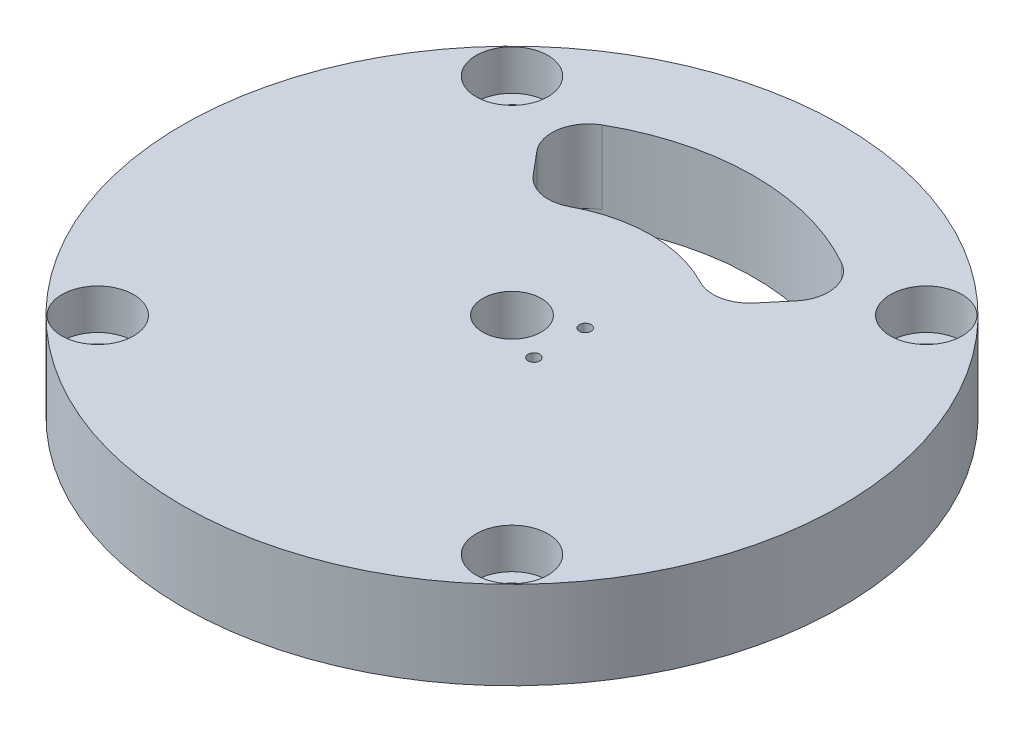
ISO-10303-21;
HEADER;
FILE_DESCRIPTION(('STEP AP214'),'2;1');
FILE_NAME('part.step','',(''),(''),'','','');
FILE_SCHEMA(('AUTOMOTIVE_DESIGN { 1 0 10303 214 1 1 1 1 }'));
ENDSEC;
DATA;
#1=APPLICATION_CONTEXT('core data for automotive mechanical design processes');
#2=APPLICATION_PROTOCOL_DEFINITION('international standard','automotive_design',2000,#1);
#3=PRODUCT_CONTEXT('',#1,'mechanical');
#4=PRODUCT('Part','Part','',(#3));
#5=PRODUCT_RELATED_PRODUCT_CATEGORY('part','',(#4));
#6=PRODUCT_DEFINITION_FORMATION('','',#4);
#7=PRODUCT_DEFINITION_CONTEXT('part definition',#1,'design');
#8=PRODUCT_DEFINITION('design','',#6,#7);
#9=PRODUCT_DEFINITION_SHAPE('','',#8);
#10=(LENGTH_UNIT() NAMED_UNIT(*) SI_UNIT(.MILLI.,.METRE.));
#11=(NAMED_UNIT(*) PLANE_ANGLE_UNIT() SI_UNIT($,.RADIAN.));
#12=(NAMED_UNIT(*) SI_UNIT($,.STERADIAN.) SOLID_ANGLE_UNIT());
#13=UNCERTAINTY_MEASURE_WITH_UNIT(LENGTH_MEASURE(1.E-05),#10,'distance_accuracy_value','');
#14=(GEOMETRIC_REPRESENTATION_CONTEXT(3) GLOBAL_UNCERTAINTY_ASSIGNED_CONTEXT((#13)) GLOBAL_UNIT_ASSIGNED_CONTEXT((#10,
#11,#12)) REPRESENTATION_CONTEXT('',''));
#15=CARTESIAN_POINT('',(0.,0.,0.));
#16=DIRECTION('',(0.,0.,1.));
#17=DIRECTION('',(1.,0.,0.));
#18=AXIS2_PLACEMENT_3D('',#15,#16,#17);
#19=CARTESIAN_POINT('',(0.,12.,0.));
#20=DIRECTION('',(0.,-1.,0.));
#21=DIRECTION('',(0.,0.,-1.));
#22=AXIS2_PLACEMENT_3D('',#19,#20,#21);
#23=CYLINDRICAL_SURFACE('',#22,19.);
#24=CARTESIAN_POINT('',(0.,2.,0.));
#25=DIRECTION('',(0.,-1.,0.));
#26=DIRECTION('',(0.,0.,-1.));
#27=AXIS2_PLACEMENT_3D('',#24,#25,#26);
#28=CIRCLE('',#27,19.);
#29=CARTESIAN_POINT('',(-8.91272703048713,2.,-16.779847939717));
#30=VERTEX_POINT('',#29);
#31=CARTESIAN_POINT('',(8.91272703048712,2.,-16.779847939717));
#32=VERTEX_POINT('',#31);
#33=EDGE_CURVE('E132',#30,#32,#28,.T.);
#34=ORIENTED_EDGE('',*,*,#33,.F.);
#35=DIRECTION('',(0.,-1.,0.));
#36=VECTOR('',#35,1.);
#37=CARTESIAN_POINT('',(-8.91272703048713,12.,-16.779847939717));
#38=LINE('',#37,#36);
#39=CARTESIAN_POINT('',(-8.91272703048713,12.,-16.779847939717));
#40=VERTEX_POINT('',#39);
#41=EDGE_CURVE('E57',#40,#30,#38,.T.);
#42=ORIENTED_EDGE('',*,*,#41,.F.);
#43=CARTESIAN_POINT('',(0.,12.,0.));
#44=DIRECTION('',(0.,1.,0.));
#45=DIRECTION('',(0.,0.,1.));
#46=AXIS2_PLACEMENT_3D('',#43,#44,#45);
#47=CIRCLE('',#46,19.);
#48=CARTESIAN_POINT('',(8.91272703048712,12.,-16.779847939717));
#49=VERTEX_POINT('',#48);
#50=EDGE_CURVE('E240',#49,#40,#47,.T.);
#51=ORIENTED_EDGE('',*,*,#50,.F.);
#52=DIRECTION('',(0.,-1.,0.));
#53=VECTOR('',#52,1.);
#54=CARTESIAN_POINT('',(8.91272703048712,12.,-16.779847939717));
#55=LINE('',#54,#53);
#56=EDGE_CURVE('E63',#49,#32,#55,.T.);
#57=ORIENTED_EDGE('',*,*,#56,.T.);
#58=EDGE_LOOP('',(#34,#42,#51,#57));
#59=FACE_BOUND('',#58,.T.);
#60=ADVANCED_FACE('F48',(#59),#23,.T.);
#61=CARTESIAN_POINT('',(-11.2581815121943,12.,-21.1955973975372));
#62=DIRECTION('',(0.,-1.,0.));
#63=DIRECTION('',(0.,0.,-1.));
#64=AXIS2_PLACEMENT_3D('',#61,#62,#63);
#65=CYLINDRICAL_SURFACE('',#64,5.);
#66=CARTESIAN_POINT('',(-11.2581815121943,2.,-21.1955973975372));
#67=DIRECTION('',(0.,-1.,0.));
#68=DIRECTION('',(0.,0.,-1.));
#69=AXIS2_PLACEMENT_3D('',#66,#67,#68);
#70=CIRCLE('',#69,5.);
#71=CARTESIAN_POINT('',(-15.0884037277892,2.,-17.9816593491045));
#72=VERTEX_POINT('',#71);
#73=EDGE_CURVE('E307',#72,#30,#70,.F.);
#74=ORIENTED_EDGE('',*,*,#73,.F.);
#75=DIRECTION('',(0.,-1.,0.));
#76=VECTOR('',#75,1.);
#77=CARTESIAN_POINT('',(-15.0884037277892,12.,-17.9816593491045));
#78=LINE('',#77,#76);
#79=CARTESIAN_POINT('',(-15.0884037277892,12.,-17.9816593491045));
#80=VERTEX_POINT('',#79);
#81=EDGE_CURVE('E161',#80,#72,#78,.T.);
#82=ORIENTED_EDGE('',*,*,#81,.F.);
#83=CARTESIAN_POINT('',(-11.2581815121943,12.,-21.1955973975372));
#84=DIRECTION('',(0.,1.,0.));
#85=DIRECTION('',(0.,0.,1.));
#86=AXIS2_PLACEMENT_3D('',#83,#84,#85);
#87=CIRCLE('',#86,5.);
#88=EDGE_CURVE('E237',#40,#80,#87,.F.);
#89=ORIENTED_EDGE('',*,*,#88,.F.);
#90=ORIENTED_EDGE('',*,*,#41,.T.);
#91=EDGE_LOOP('',(#74,#82,#89,#90));
#92=FACE_BOUND('',#91,.T.);
#93=ADVANCED_FACE('F326',(#92),#65,.F.);
#94=CARTESIAN_POINT('',(0.,12.,0.));
#95=DIRECTION('',(-0.766044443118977,0.,0.642787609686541));
#96=DIRECTION('',(0.642787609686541,0.,0.766044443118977));
#97=AXIS2_PLACEMENT_3D('',#94,#95,#96);
#98=PLANE('',#97);
#99=DIRECTION('',(0.642787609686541,0.,0.766044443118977));
#100=VECTOR('',#99,1.);
#101=CARTESIAN_POINT('',(0.,2.,0.));
#102=LINE('',#101,#100);
#103=CARTESIAN_POINT('',(-17.7087694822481,2.,-21.1044896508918));
#104=VERTEX_POINT('',#103);
#105=EDGE_CURVE('E304',#104,#72,#102,.T.);
#106=ORIENTED_EDGE('',*,*,#105,.F.);
#107=DIRECTION('',(0.,-1.,0.));
#108=VECTOR('',#107,1.);
#109=CARTESIAN_POINT('',(-17.7087694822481,12.,-21.1044896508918));
#110=LINE('',#109,#108);
#111=CARTESIAN_POINT('',(-17.7087694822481,12.,-21.1044896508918));
#112=VERTEX_POINT('',#111);
#113=EDGE_CURVE('E153',#112,#104,#110,.T.);
#114=ORIENTED_EDGE('',*,*,#113,.F.);
#115=DIRECTION('',(-0.642787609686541,0.,-0.766044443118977));
#116=VECTOR('',#115,1.);
#117=CARTESIAN_POINT('',(0.,12.,0.));
#118=LINE('',#117,#116);
#119=EDGE_CURVE('E234',#80,#112,#118,.T.);
#120=ORIENTED_EDGE('',*,*,#119,.F.);
#121=ORIENTED_EDGE('',*,*,#81,.T.);
#122=EDGE_LOOP('',(#106,#114,#120,#121));
#123=FACE_BOUND('',#122,.T.);
#124=ADVANCED_FACE('F323',(#123),#98,.F.);
#125=CARTESIAN_POINT('',(-13.8785472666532,12.,-24.3184276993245));
#126=DIRECTION('',(0.,-1.,0.));
#127=DIRECTION('',(0.,0.,-1.));
#128=AXIS2_PLACEMENT_3D('',#125,#126,#127);
#129=CYLINDRICAL_SURFACE('',#128,5.);
#130=CARTESIAN_POINT('',(-13.8785472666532,2.,-24.3184276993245));
#131=DIRECTION('',(0.,-1.,0.));
#132=DIRECTION('',(0.,0.,-1.));
#133=AXIS2_PLACEMENT_3D('',#130,#131,#132);
#134=CIRCLE('',#133,5.);
#135=CARTESIAN_POINT('',(-16.3568592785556,2.,-28.6610040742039));
#136=VERTEX_POINT('',#135);
#137=EDGE_CURVE('E301',#136,#104,#134,.F.);
#138=ORIENTED_EDGE('',*,*,#137,.F.);
#139=DIRECTION('',(0.,-1.,0.));
#140=VECTOR('',#139,1.);
#141=CARTESIAN_POINT('',(-16.3568592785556,12.,-28.6610040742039));
#142=LINE('',#141,#140);
#143=CARTESIAN_POINT('',(-16.3568592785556,12.,-28.6610040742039));
#144=VERTEX_POINT('',#143);
#145=EDGE_CURVE('E141',#144,#136,#142,.T.);
#146=ORIENTED_EDGE('',*,*,#145,.F.);
#147=CARTESIAN_POINT('',(-13.8785472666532,12.,-24.3184276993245));
#148=DIRECTION('',(0.,1.,0.));
#149=DIRECTION('',(0.,0.,1.));
#150=AXIS2_PLACEMENT_3D('',#147,#148,#149);
#151=CIRCLE('',#150,5.);
#152=EDGE_CURVE('E231',#112,#144,#151,.F.);
#153=ORIENTED_EDGE('',*,*,#152,.F.);
#154=ORIENTED_EDGE('',*,*,#113,.T.);
#155=EDGE_LOOP('',(#138,#146,#153,#154));
#156=FACE_BOUND('',#155,.T.);
#157=ADVANCED_FACE('F319',(#156),#129,.F.);
#158=CARTESIAN_POINT('',(13.8785472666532,12.,-24.3184276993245));
#159=DIRECTION('',(0.,-1.,0.));
#160=DIRECTION('',(0.,0.,-1.));
#161=AXIS2_PLACEMENT_3D('',#158,#159,#160);
#162=CYLINDRICAL_SURFACE('',#161,5.);
#163=DIRECTION('',(0.,-1.,0.));
#164=VECTOR('',#163,1.);
#165=CARTESIAN_POINT('',(16.3568592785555,12.,-28.6610040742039));
#166=LINE('',#165,#164);
#167=CARTESIAN_POINT('',(16.3568592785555,12.,-28.6610040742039));
#168=VERTEX_POINT('',#167);
#169=CARTESIAN_POINT('',(16.3568592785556,2.,-28.6610040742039));
#170=VERTEX_POINT('',#169);
#171=EDGE_CURVE('E138',#168,#170,#166,.T.);
#172=ORIENTED_EDGE('',*,*,#171,.T.);
#173=CARTESIAN_POINT('',(13.8785472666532,2.,-24.3184276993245));
#174=DIRECTION('',(0.,-1.,0.));
#175=DIRECTION('',(0.,0.,-1.));
#176=AXIS2_PLACEMENT_3D('',#173,#174,#175);
#177=CIRCLE('',#176,5.);
#178=CARTESIAN_POINT('',(17.7087694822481,2.,-21.1044896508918));
#179=VERTEX_POINT('',#178);
#180=EDGE_CURVE('E122',#170,#179,#177,.T.);
#181=ORIENTED_EDGE('',*,*,#180,.T.);
#182=DIRECTION('',(0.,-1.,0.));
#183=VECTOR('',#182,1.);
#184=CARTESIAN_POINT('',(17.7087694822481,12.,-21.1044896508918));
#185=LINE('',#184,#183);
#186=CARTESIAN_POINT('',(17.7087694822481,12.,-21.1044896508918));
#187=VERTEX_POINT('',#186);
#188=EDGE_CURVE('E149',#187,#179,#185,.T.);
#189=ORIENTED_EDGE('',*,*,#188,.F.);
#190=CARTESIAN_POINT('',(13.8785472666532,12.,-24.3184276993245));
#191=DIRECTION('',(0.,1.,0.));
#192=DIRECTION('',(0.,0.,1.));
#193=AXIS2_PLACEMENT_3D('',#190,#191,#192);
#194=CIRCLE('',#193,5.);
#195=EDGE_CURVE('E147',#187,#168,#194,.T.);
#196=ORIENTED_EDGE('',*,*,#195,.T.);
#197=EDGE_LOOP('',(#172,#181,#189,#196));
#198=FACE_BOUND('',#197,.T.);
#199=ADVANCED_FACE('F145',(#198),#162,.F.);
#200=CARTESIAN_POINT('',(0.,12.,0.));
#201=DIRECTION('',(-0.766044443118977,0.,-0.64278760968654));
#202=DIRECTION('',(-0.64278760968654,0.,0.766044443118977));
#203=AXIS2_PLACEMENT_3D('',#200,#201,#202);
#204=PLANE('',#203);
#205=ORIENTED_EDGE('',*,*,#188,.T.);
#206=DIRECTION('',(-0.64278760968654,0.,0.766044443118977));
#207=VECTOR('',#206,1.);
#208=CARTESIAN_POINT('',(0.,2.,0.));
#209=LINE('',#208,#207);
#210=CARTESIAN_POINT('',(15.0884037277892,2.,-17.9816593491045));
#211=VERTEX_POINT('',#210);
#212=EDGE_CURVE('E127',#179,#211,#209,.T.);
#213=ORIENTED_EDGE('',*,*,#212,.T.);
#214=DIRECTION('',(0.,-1.,0.));
#215=VECTOR('',#214,1.);
#216=CARTESIAN_POINT('',(15.0884037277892,12.,-17.9816593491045));
#217=LINE('',#216,#215);
#218=CARTESIAN_POINT('',(15.0884037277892,12.,-17.9816593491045));
#219=VERTEX_POINT('',#218);
#220=EDGE_CURVE('E71',#219,#211,#217,.T.);
#221=ORIENTED_EDGE('',*,*,#220,.F.);
#222=DIRECTION('',(0.64278760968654,0.,-0.766044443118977));
#223=VECTOR('',#222,1.);
#224=CARTESIAN_POINT('',(0.,12.,0.));
#225=LINE('',#224,#223);
#226=EDGE_CURVE('E223',#219,#187,#225,.T.);
#227=ORIENTED_EDGE('',*,*,#226,.T.);
#228=EDGE_LOOP('',(#205,#213,#221,#227));
#229=FACE_BOUND('',#228,.T.);
#230=ADVANCED_FACE('F313',(#229),#204,.T.);
#231=CARTESIAN_POINT('',(0.,12.,0.));
#232=DIRECTION('',(0.,-1.,0.));
#233=DIRECTION('',(0.,0.,-1.));
#234=AXIS2_PLACEMENT_3D('',#231,#232,#233);
#235=CYLINDRICAL_SURFACE('',#234,4.);
#236=CARTESIAN_POINT('',(0.,12.,0.));
#237=DIRECTION('',(0.,1.,0.));
#238=DIRECTION('',(0.,0.,1.));
#239=AXIS2_PLACEMENT_3D('',#236,#237,#238);
#240=CIRCLE('',#239,4.);
#241=CARTESIAN_POINT('',(0.,12.,4.));
#242=VERTEX_POINT('',#241);
#243=EDGE_CURVE('E215',#242,#242,#240,.T.);
#244=ORIENTED_EDGE('',*,*,#243,.T.);
#245=EDGE_LOOP('',(#244));
#246=FACE_BOUND('',#245,.T.);
#247=CARTESIAN_POINT('',(0.,2.,0.));
#248=DIRECTION('',(0.,-1.,0.));
#249=DIRECTION('',(0.,0.,-1.));
#250=AXIS2_PLACEMENT_3D('',#247,#248,#249);
#251=CIRCLE('',#250,4.);
#252=CARTESIAN_POINT('',(0.,2.,-4.));
#253=VERTEX_POINT('',#252);
#254=EDGE_CURVE('E297',#253,#253,#251,.T.);
#255=ORIENTED_EDGE('',*,*,#254,.T.);
#256=EDGE_LOOP('',(#255));
#257=FACE_BOUND('',#256,.T.);
#258=ADVANCED_FACE('F342',(#246,#257),#235,.F.);
#259=CARTESIAN_POINT('',(11.2581815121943,12.,-21.1955973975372));
#260=DIRECTION('',(0.,-1.,0.));
#261=DIRECTION('',(0.,0.,-1.));
#262=AXIS2_PLACEMENT_3D('',#259,#260,#261);
#263=CYLINDRICAL_SURFACE('',#262,5.);
#264=ORIENTED_EDGE('',*,*,#220,.T.);
#265=CARTESIAN_POINT('',(11.2581815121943,2.,-21.1955973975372));
#266=DIRECTION('',(0.,-1.,0.));
#267=DIRECTION('',(0.,0.,-1.));
#268=AXIS2_PLACEMENT_3D('',#265,#266,#267);
#269=CIRCLE('',#268,5.);
#270=EDGE_CURVE('E11',#211,#32,#269,.T.);
#271=ORIENTED_EDGE('',*,*,#270,.T.);
#272=ORIENTED_EDGE('',*,*,#56,.F.);
#273=CARTESIAN_POINT('',(11.2581815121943,12.,-21.1955973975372));
#274=DIRECTION('',(0.,1.,0.));
#275=DIRECTION('',(0.,0.,1.));
#276=AXIS2_PLACEMENT_3D('',#273,#274,#275);
#277=CIRCLE('',#276,5.);
#278=EDGE_CURVE('E197',#49,#219,#277,.T.);
#279=ORIENTED_EDGE('',*,*,#278,.T.);
#280=EDGE_LOOP('',(#264,#271,#272,#279));
#281=FACE_BOUND('',#280,.T.);
#282=ADVANCED_FACE('F218',(#281),#263,.F.);
#283=CARTESIAN_POINT('',(28.2842712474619,12.,-28.2842712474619));
#284=DIRECTION('',(0.,-1.,0.));
#285=DIRECTION('',(0.,0.,-1.));
#286=AXIS2_PLACEMENT_3D('',#283,#284,#285);
#287=CYLINDRICAL_SURFACE('',#286,3.);
#288=CARTESIAN_POINT('',(28.2842712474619,0.,-28.2842712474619));
#289=DIRECTION('',(0.,1.,0.));
#290=DIRECTION('',(0.,0.,1.));
#291=AXIS2_PLACEMENT_3D('',#288,#289,#290);
#292=CIRCLE('',#291,3.);
#293=CARTESIAN_POINT('',(28.2842712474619,0.,-25.2842712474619));
#294=VERTEX_POINT('',#293);
#295=EDGE_CURVE('E203',#294,#294,#292,.T.);
#296=ORIENTED_EDGE('',*,*,#295,.F.);
#297=EDGE_LOOP('',(#296));
#298=FACE_BOUND('',#297,.T.);
#299=CARTESIAN_POINT('',(28.2842712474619,6.5,-28.2842712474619));
#300=DIRECTION('',(0.,1.,0.));
#301=DIRECTION('',(0.,0.,1.));
#302=AXIS2_PLACEMENT_3D('',#299,#300,#301);
#303=CIRCLE('',#302,3.);
#304=CARTESIAN_POINT('',(28.2842712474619,6.5,-25.2842712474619));
#305=VERTEX_POINT('',#304);
#306=EDGE_CURVE('E180',#305,#305,#303,.T.);
#307=ORIENTED_EDGE('',*,*,#306,.T.);
#308=EDGE_LOOP('',(#307));
#309=FACE_BOUND('',#308,.T.);
#310=ADVANCED_FACE('F346',(#298,#309),#287,.F.);
#311=CARTESIAN_POINT('',(28.2842712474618,12.,28.2842712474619));
#312=DIRECTION('',(0.,-1.,0.));
#313=DIRECTION('',(0.,0.,-1.));
#314=AXIS2_PLACEMENT_3D('',#311,#312,#313);
#315=CYLINDRICAL_SURFACE('',#314,2.99999999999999);
#316=CARTESIAN_POINT('',(28.2842712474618,0.,28.2842712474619));
#317=DIRECTION('',(0.,1.,0.));
#318=DIRECTION('',(0.,0.,1.));
#319=AXIS2_PLACEMENT_3D('',#316,#317,#318);
#320=CIRCLE('',#319,2.99999999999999);
#321=CARTESIAN_POINT('',(28.2842712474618,0.,31.2842712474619));
#322=VERTEX_POINT('',#321);
#323=EDGE_CURVE('E194',#322,#322,#320,.T.);
#324=ORIENTED_EDGE('',*,*,#323,.F.);
#325=EDGE_LOOP('',(#324));
#326=FACE_BOUND('',#325,.T.);
#327=CARTESIAN_POINT('',(28.2842712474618,6.5,28.2842712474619));
#328=DIRECTION('',(0.,1.,0.));
#329=DIRECTION('',(0.,0.,1.));
#330=AXIS2_PLACEMENT_3D('',#327,#328,#329);
#331=CIRCLE('',#330,2.99999999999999);
#332=CARTESIAN_POINT('',(28.2842712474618,6.5,31.2842712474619));
#333=VERTEX_POINT('',#332);
#334=EDGE_CURVE('E177',#333,#333,#331,.T.);
#335=ORIENTED_EDGE('',*,*,#334,.T.);
#336=EDGE_LOOP('',(#335));
#337=FACE_BOUND('',#336,.T.);
#338=ADVANCED_FACE('F349',(#326,#337),#315,.F.);
#339=CARTESIAN_POINT('',(-28.2842712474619,12.,28.2842712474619));
#340=DIRECTION('',(0.,-1.,0.));
#341=DIRECTION('',(0.,0.,-1.));
#342=AXIS2_PLACEMENT_3D('',#339,#340,#341);
#343=CYLINDRICAL_SURFACE('',#342,3.);
#344=CARTESIAN_POINT('',(-28.2842712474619,0.,28.2842712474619));
#345=DIRECTION('',(0.,1.,0.));
#346=DIRECTION('',(0.,0.,1.));
#347=AXIS2_PLACEMENT_3D('',#344,#345,#346);
#348=CIRCLE('',#347,3.);
#349=CARTESIAN_POINT('',(-28.2842712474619,0.,31.2842712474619));
#350=VERTEX_POINT('',#349);
#351=EDGE_CURVE('E188',#350,#350,#348,.T.);
#352=ORIENTED_EDGE('',*,*,#351,.F.);
#353=EDGE_LOOP('',(#352));
#354=FACE_BOUND('',#353,.T.);
#355=CARTESIAN_POINT('',(-28.2842712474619,6.5,28.2842712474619));
#356=DIRECTION('',(0.,1.,0.));
#357=DIRECTION('',(0.,0.,1.));
#358=AXIS2_PLACEMENT_3D('',#355,#356,#357);
#359=CIRCLE('',#358,3.);
#360=CARTESIAN_POINT('',(-28.2842712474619,6.5,31.2842712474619));
#361=VERTEX_POINT('',#360);
#362=EDGE_CURVE('E172',#361,#361,#359,.T.);
#363=ORIENTED_EDGE('',*,*,#362,.T.);
#364=EDGE_LOOP('',(#363));
#365=FACE_BOUND('',#364,.T.);
#366=ADVANCED_FACE('F352',(#354,#365),#343,.F.);
#367=CARTESIAN_POINT('',(-28.2842712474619,12.,-28.2842712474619));
#368=DIRECTION('',(0.,-1.,0.));
#369=DIRECTION('',(0.,0.,-1.));
#370=AXIS2_PLACEMENT_3D('',#367,#368,#369);
#371=CYLINDRICAL_SURFACE('',#370,3.);
#372=CARTESIAN_POINT('',(-28.2842712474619,0.,-28.2842712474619));
#373=DIRECTION('',(0.,1.,0.));
#374=DIRECTION('',(0.,0.,1.));
#375=AXIS2_PLACEMENT_3D('',#372,#373,#374);
#376=CIRCLE('',#375,3.);
#377=CARTESIAN_POINT('',(-28.2842712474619,0.,-25.2842712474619));
#378=VERTEX_POINT('',#377);
#379=EDGE_CURVE('E183',#378,#378,#376,.T.);
#380=ORIENTED_EDGE('',*,*,#379,.F.);
#381=EDGE_LOOP('',(#380));
#382=FACE_BOUND('',#381,.T.);
#383=CARTESIAN_POINT('',(-28.2842712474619,6.5,-28.2842712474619));
#384=DIRECTION('',(0.,1.,0.));
#385=DIRECTION('',(0.,0.,1.));
#386=AXIS2_PLACEMENT_3D('',#383,#384,#385);
#387=CIRCLE('',#386,3.);
#388=CARTESIAN_POINT('',(-28.2842712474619,6.5,-25.2842712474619));
#389=VERTEX_POINT('',#388);
#390=EDGE_CURVE('E168',#389,#389,#387,.T.);
#391=ORIENTED_EDGE('',*,*,#390,.T.);
#392=EDGE_LOOP('',(#391));
#393=FACE_BOUND('',#392,.T.);
#394=ADVANCED_FACE('F50',(#382,#393),#371,.F.);
#395=CARTESIAN_POINT('',(0.,12.,0.));
#396=DIRECTION('',(0.,-1.,0.));
#397=DIRECTION('',(0.,0.,-1.));
#398=AXIS2_PLACEMENT_3D('',#395,#396,#397);
#399=CYLINDRICAL_SURFACE('',#398,33.);
#400=CARTESIAN_POINT('',(0.,0.,0.));
#401=DIRECTION('',(0.,1.,0.));
#402=DIRECTION('',(0.,0.,1.));
#403=AXIS2_PLACEMENT_3D('',#400,#401,#402);
#404=CIRCLE('',#403,33.);
#405=CARTESIAN_POINT('',(0.,0.,33.));
#406=VERTEX_POINT('',#405);
#407=EDGE_CURVE('E211',#406,#406,#404,.T.);
#408=ORIENTED_EDGE('',*,*,#407,.F.);
#409=EDGE_LOOP('',(#408));
#410=FACE_BOUND('',#409,.T.);
#411=CARTESIAN_POINT('',(0.,2.,0.));
#412=DIRECTION('',(0.,-1.,0.));
#413=DIRECTION('',(0.,0.,-1.));
#414=AXIS2_PLACEMENT_3D('',#411,#412,#413);
#415=CIRCLE('',#414,33.);
#416=EDGE_CURVE('E125',#170,#136,#415,.T.);
#417=ORIENTED_EDGE('',*,*,#416,.F.);
#418=ORIENTED_EDGE('',*,*,#171,.F.);
#419=CARTESIAN_POINT('',(0.,12.,0.));
#420=DIRECTION('',(0.,1.,0.));
#421=DIRECTION('',(0.,0.,1.));
#422=AXIS2_PLACEMENT_3D('',#419,#420,#421);
#423=CIRCLE('',#422,33.);
#424=EDGE_CURVE('E226',#168,#144,#423,.T.);
#425=ORIENTED_EDGE('',*,*,#424,.T.);
#426=ORIENTED_EDGE('',*,*,#145,.T.);
#427=EDGE_LOOP('',(#417,#418,#425,#426));
#428=FACE_BOUND('',#427,.T.);
#429=ADVANCED_FACE('F136',(#410,#428),#399,.F.);
#430=CARTESIAN_POINT('',(0.,12.,0.));
#431=DIRECTION('',(0.,-1.,0.));
#432=DIRECTION('',(0.,0.,-1.));
#433=AXIS2_PLACEMENT_3D('',#430,#431,#432);
#434=CYLINDRICAL_SURFACE('',#433,45.);
#435=CARTESIAN_POINT('',(0.,12.,0.));
#436=DIRECTION('',(0.,1.,0.));
#437=DIRECTION('',(0.,0.,1.));
#438=AXIS2_PLACEMENT_3D('',#435,#436,#437);
#439=CIRCLE('',#438,45.);
#440=CARTESIAN_POINT('',(0.,12.,45.));
#441=VERTEX_POINT('',#440);
#442=EDGE_CURVE('E243',#441,#441,#439,.T.);
#443=ORIENTED_EDGE('',*,*,#442,.F.);
#444=EDGE_LOOP('',(#443));
#445=FACE_BOUND('',#444,.T.);
#446=CARTESIAN_POINT('',(0.,0.,0.));
#447=DIRECTION('',(0.,1.,0.));
#448=DIRECTION('',(0.,0.,1.));
#449=AXIS2_PLACEMENT_3D('',#446,#447,#448);
#450=CIRCLE('',#449,45.);
#451=CARTESIAN_POINT('',(0.,0.,45.));
#452=VERTEX_POINT('',#451);
#453=EDGE_CURVE('E207',#452,#452,#450,.T.);
#454=ORIENTED_EDGE('',*,*,#453,.T.);
#455=EDGE_LOOP('',(#454));
#456=FACE_BOUND('',#455,.T.);
#457=ADVANCED_FACE('F338',(#445,#456),#434,.T.);
#458=CARTESIAN_POINT('',(0.,12.,0.));
#459=DIRECTION('',(0.,1.,0.));
#460=DIRECTION('',(0.,0.,1.));
#461=AXIS2_PLACEMENT_3D('',#458,#459,#460);
#462=PLANE('',#461);
#463=CARTESIAN_POINT('',(6.5,12.,-3.5));
#464=DIRECTION('',(0.,1.,0.));
#465=DIRECTION('',(0.,0.,1.));
#466=AXIS2_PLACEMENT_3D('',#463,#464,#465);
#467=CIRCLE('',#466,0.79999999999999);
#468=CARTESIAN_POINT('',(6.5,12.,-2.70000000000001));
#469=VERTEX_POINT('',#468);
#470=EDGE_CURVE('E293',#469,#469,#467,.T.);
#471=ORIENTED_EDGE('',*,*,#470,.F.);
#472=EDGE_LOOP('',(#471));
#473=FACE_BOUND('',#472,.T.);
#474=CARTESIAN_POINT('',(6.5,12.,3.5));
#475=DIRECTION('',(0.,1.,0.));
#476=DIRECTION('',(0.,0.,1.));
#477=AXIS2_PLACEMENT_3D('',#474,#475,#476);
#478=CIRCLE('',#477,0.79999999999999);
#479=CARTESIAN_POINT('',(6.5,12.,4.29999999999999));
#480=VERTEX_POINT('',#479);
#481=EDGE_CURVE('E285',#480,#480,#478,.T.);
#482=ORIENTED_EDGE('',*,*,#481,.F.);
#483=EDGE_LOOP('',(#482));
#484=FACE_BOUND('',#483,.T.);
#485=CARTESIAN_POINT('',(-28.2842712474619,12.,-28.2842712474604));
#486=DIRECTION('',(0.,1.,0.));
#487=DIRECTION('',(0.,0.,1.));
#488=AXIS2_PLACEMENT_3D('',#485,#486,#487);
#489=CIRCLE('',#488,4.9);
#490=CARTESIAN_POINT('',(-28.2842712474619,12.,-23.3842712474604));
#491=VERTEX_POINT('',#490);
#492=EDGE_CURVE('E262',#491,#491,#489,.T.);
#493=ORIENTED_EDGE('',*,*,#492,.F.);
#494=EDGE_LOOP('',(#493));
#495=FACE_BOUND('',#494,.T.);
#496=CARTESIAN_POINT('',(-28.2842712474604,12.,28.2842712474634));
#497=DIRECTION('',(0.,1.,0.));
#498=DIRECTION('',(0.,0.,1.));
#499=AXIS2_PLACEMENT_3D('',#496,#497,#498);
#500=CIRCLE('',#499,4.9);
#501=CARTESIAN_POINT('',(-28.2842712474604,12.,33.1842712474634));
#502=VERTEX_POINT('',#501);
#503=EDGE_CURVE('E271',#502,#502,#500,.T.);
#504=ORIENTED_EDGE('',*,*,#503,.F.);
#505=EDGE_LOOP('',(#504));
#506=FACE_BOUND('',#505,.T.);
#507=CARTESIAN_POINT('',(28.2842712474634,12.,28.284271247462));
#508=DIRECTION('',(0.,1.,0.));
#509=DIRECTION('',(0.,0.,1.));
#510=AXIS2_PLACEMENT_3D('',#507,#508,#509);
#511=CIRCLE('',#510,4.9);
#512=CARTESIAN_POINT('',(28.2842712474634,12.,33.184271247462));
#513=VERTEX_POINT('',#512);
#514=EDGE_CURVE('E254',#513,#513,#511,.T.);
#515=ORIENTED_EDGE('',*,*,#514,.F.);
#516=EDGE_LOOP('',(#515));
#517=FACE_BOUND('',#516,.T.);
#518=CARTESIAN_POINT('',(28.2842712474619,12.,-28.2842712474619));
#519=DIRECTION('',(0.,1.,0.));
#520=DIRECTION('',(0.,0.,1.));
#521=AXIS2_PLACEMENT_3D('',#518,#519,#520);
#522=CIRCLE('',#521,4.9);
#523=CARTESIAN_POINT('',(28.2842712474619,12.,-23.3842712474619));
#524=VERTEX_POINT('',#523);
#525=EDGE_CURVE('E250',#524,#524,#522,.T.);
#526=ORIENTED_EDGE('',*,*,#525,.F.);
#527=EDGE_LOOP('',(#526));
#528=FACE_BOUND('',#527,.T.);
#529=ORIENTED_EDGE('',*,*,#243,.F.);
#530=EDGE_LOOP('',(#529));
#531=FACE_BOUND('',#530,.T.);
#532=ORIENTED_EDGE('',*,*,#442,.T.);
#533=EDGE_LOOP('',(#532));
#534=FACE_BOUND('',#533,.T.);
#535=ORIENTED_EDGE('',*,*,#50,.T.);
#536=ORIENTED_EDGE('',*,*,#88,.T.);
#537=ORIENTED_EDGE('',*,*,#119,.T.);
#538=ORIENTED_EDGE('',*,*,#152,.T.);
#539=ORIENTED_EDGE('',*,*,#424,.F.);
#540=ORIENTED_EDGE('',*,*,#195,.F.);
#541=ORIENTED_EDGE('',*,*,#226,.F.);
#542=ORIENTED_EDGE('',*,*,#278,.F.);
#543=EDGE_LOOP('',(#535,#536,#537,#538,#539,#540,#541,#542));
#544=FACE_BOUND('',#543,.T.);
#545=ADVANCED_FACE('F314',(#473,#484,#495,#506,#517,#528,#531,#534,#544),#462,.T.);
#546=CARTESIAN_POINT('',(0.,0.,0.));
#547=DIRECTION('',(0.,1.,0.));
#548=DIRECTION('',(0.,0.,1.));
#549=AXIS2_PLACEMENT_3D('',#546,#547,#548);
#550=PLANE('',#549);
#551=ORIENTED_EDGE('',*,*,#379,.T.);
#552=EDGE_LOOP('',(#551));
#553=FACE_BOUND('',#552,.T.);
#554=ORIENTED_EDGE('',*,*,#351,.T.);
#555=EDGE_LOOP('',(#554));
#556=FACE_BOUND('',#555,.T.);
#557=ORIENTED_EDGE('',*,*,#323,.T.);
#558=EDGE_LOOP('',(#557));
#559=FACE_BOUND('',#558,.T.);
#560=ORIENTED_EDGE('',*,*,#295,.T.);
#561=EDGE_LOOP('',(#560));
#562=FACE_BOUND('',#561,.T.);
#563=ORIENTED_EDGE('',*,*,#453,.F.);
#564=EDGE_LOOP('',(#563));
#565=FACE_BOUND('',#564,.T.);
#566=ORIENTED_EDGE('',*,*,#407,.T.);
#567=EDGE_LOOP('',(#566));
#568=FACE_BOUND('',#567,.T.);
#569=ADVANCED_FACE('F380',(#553,#556,#559,#562,#565,#568),#550,.F.);
#570=CARTESIAN_POINT('',(28.2842712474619,6.5,-28.2842712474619));
#571=DIRECTION('',(0.,1.,0.));
#572=DIRECTION('',(0.,0.,1.));
#573=AXIS2_PLACEMENT_3D('',#570,#571,#572);
#574=CYLINDRICAL_SURFACE('',#573,4.9);
#575=CARTESIAN_POINT('',(28.2842712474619,6.5,-28.2842712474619));
#576=DIRECTION('',(0.,1.,0.));
#577=DIRECTION('',(0.,0.,1.));
#578=AXIS2_PLACEMENT_3D('',#575,#576,#577);
#579=CIRCLE('',#578,4.9);
#580=CARTESIAN_POINT('',(28.2842712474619,6.5,-23.3842712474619));
#581=VERTEX_POINT('',#580);
#582=EDGE_CURVE('E173',#581,#581,#579,.T.);
#583=ORIENTED_EDGE('',*,*,#582,.F.);
#584=EDGE_LOOP('',(#583));
#585=FACE_BOUND('',#584,.T.);
#586=ORIENTED_EDGE('',*,*,#525,.T.);
#587=EDGE_LOOP('',(#586));
#588=FACE_BOUND('',#587,.T.);
#589=ADVANCED_FACE('F395',(#585,#588),#574,.F.);
#590=CARTESIAN_POINT('',(28.2842712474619,6.5,-28.2842712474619));
#591=DIRECTION('',(0.,1.,0.));
#592=DIRECTION('',(0.,0.,1.));
#593=AXIS2_PLACEMENT_3D('',#590,#591,#592);
#594=PLANE('',#593);
#595=ORIENTED_EDGE('',*,*,#306,.F.);
#596=EDGE_LOOP('',(#595));
#597=FACE_BOUND('',#596,.T.);
#598=ORIENTED_EDGE('',*,*,#582,.T.);
#599=EDGE_LOOP('',(#598));
#600=FACE_BOUND('',#599,.T.);
#601=ADVANCED_FACE('F465',(#597,#600),#594,.T.);
#602=CARTESIAN_POINT('',(28.2842712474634,6.5,28.284271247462));
#603=DIRECTION('',(0.,1.,0.));
#604=DIRECTION('',(0.,0.,1.));
#605=AXIS2_PLACEMENT_3D('',#602,#603,#604);
#606=CYLINDRICAL_SURFACE('',#605,4.9);
#607=CARTESIAN_POINT('',(28.2842712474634,6.5,28.284271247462));
#608=DIRECTION('',(0.,1.,0.));
#609=DIRECTION('',(0.,0.,1.));
#610=AXIS2_PLACEMENT_3D('',#607,#608,#609);
#611=CIRCLE('',#610,4.9);
#612=CARTESIAN_POINT('',(28.2842712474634,6.5,33.184271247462));
#613=VERTEX_POINT('',#612);
#614=EDGE_CURVE('E275',#613,#613,#611,.T.);
#615=ORIENTED_EDGE('',*,*,#614,.F.);
#616=EDGE_LOOP('',(#615));
#617=FACE_BOUND('',#616,.T.);
#618=ORIENTED_EDGE('',*,*,#514,.T.);
#619=EDGE_LOOP('',(#618));
#620=FACE_BOUND('',#619,.T.);
#621=ADVANCED_FACE('F477',(#617,#620),#606,.F.);
#622=CARTESIAN_POINT('',(28.2842712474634,6.5,28.284271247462));
#623=DIRECTION('',(0.,1.,0.));
#624=DIRECTION('',(0.,0.,1.));
#625=AXIS2_PLACEMENT_3D('',#622,#623,#624);
#626=PLANE('',#625);
#627=ORIENTED_EDGE('',*,*,#334,.F.);
#628=EDGE_LOOP('',(#627));
#629=FACE_BOUND('',#628,.T.);
#630=ORIENTED_EDGE('',*,*,#614,.T.);
#631=EDGE_LOOP('',(#630));
#632=FACE_BOUND('',#631,.T.);
#633=ADVANCED_FACE('F374',(#629,#632),#626,.T.);
#634=CARTESIAN_POINT('',(-28.2842712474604,6.5,28.2842712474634));
#635=DIRECTION('',(0.,1.,0.));
#636=DIRECTION('',(0.,0.,1.));
#637=AXIS2_PLACEMENT_3D('',#634,#635,#636);
#638=CYLINDRICAL_SURFACE('',#637,4.9);
#639=CARTESIAN_POINT('',(-28.2842712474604,6.5,28.2842712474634));
#640=DIRECTION('',(0.,1.,0.));
#641=DIRECTION('',(0.,0.,1.));
#642=AXIS2_PLACEMENT_3D('',#639,#640,#641);
#643=CIRCLE('',#642,4.9);
#644=CARTESIAN_POINT('',(-28.2842712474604,6.5,33.1842712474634));
#645=VERTEX_POINT('',#644);
#646=EDGE_CURVE('E267',#645,#645,#643,.T.);
#647=ORIENTED_EDGE('',*,*,#646,.F.);
#648=EDGE_LOOP('',(#647));
#649=FACE_BOUND('',#648,.T.);
#650=ORIENTED_EDGE('',*,*,#503,.T.);
#651=EDGE_LOOP('',(#650));
#652=FACE_BOUND('',#651,.T.);
#653=ADVANCED_FACE('F368',(#649,#652),#638,.F.);
#654=CARTESIAN_POINT('',(-28.2842712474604,6.5,28.2842712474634));
#655=DIRECTION('',(0.,1.,0.));
#656=DIRECTION('',(0.,0.,1.));
#657=AXIS2_PLACEMENT_3D('',#654,#655,#656);
#658=PLANE('',#657);
#659=ORIENTED_EDGE('',*,*,#362,.F.);
#660=EDGE_LOOP('',(#659));
#661=FACE_BOUND('',#660,.T.);
#662=ORIENTED_EDGE('',*,*,#646,.T.);
#663=EDGE_LOOP('',(#662));
#664=FACE_BOUND('',#663,.T.);
#665=ADVANCED_FACE('F364',(#661,#664),#658,.T.);
#666=CARTESIAN_POINT('',(-28.2842712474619,6.5,-28.2842712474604));
#667=DIRECTION('',(0.,1.,0.));
#668=DIRECTION('',(0.,0.,1.));
#669=AXIS2_PLACEMENT_3D('',#666,#667,#668);
#670=CYLINDRICAL_SURFACE('',#669,4.9);
#671=CARTESIAN_POINT('',(-28.2842712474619,6.5,-28.2842712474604));
#672=DIRECTION('',(0.,1.,0.));
#673=DIRECTION('',(0.,0.,1.));
#674=AXIS2_PLACEMENT_3D('',#671,#672,#673);
#675=CIRCLE('',#674,4.9);
#676=CARTESIAN_POINT('',(-28.2842712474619,6.5,-23.3842712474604));
#677=VERTEX_POINT('',#676);
#678=EDGE_CURVE('E258',#677,#677,#675,.T.);
#679=ORIENTED_EDGE('',*,*,#678,.F.);
#680=EDGE_LOOP('',(#679));
#681=FACE_BOUND('',#680,.T.);
#682=ORIENTED_EDGE('',*,*,#492,.T.);
#683=EDGE_LOOP('',(#682));
#684=FACE_BOUND('',#683,.T.);
#685=ADVANCED_FACE('F367',(#681,#684),#670,.F.);
#686=CARTESIAN_POINT('',(-28.2842712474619,6.5,-28.2842712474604));
#687=DIRECTION('',(0.,1.,0.));
#688=DIRECTION('',(0.,0.,1.));
#689=AXIS2_PLACEMENT_3D('',#686,#687,#688);
#690=PLANE('',#689);
#691=ORIENTED_EDGE('',*,*,#390,.F.);
#692=EDGE_LOOP('',(#691));
#693=FACE_BOUND('',#692,.T.);
#694=ORIENTED_EDGE('',*,*,#678,.T.);
#695=EDGE_LOOP('',(#694));
#696=FACE_BOUND('',#695,.T.);
#697=ADVANCED_FACE('F522',(#693,#696),#690,.T.);
#698=CARTESIAN_POINT('',(6.5,6.8,3.5));
#699=DIRECTION('',(0.,1.,0.));
#700=DIRECTION('',(0.,0.,1.));
#701=AXIS2_PLACEMENT_3D('',#698,#699,#700);
#702=CONICAL_SURFACE('',#701,0.799999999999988,1.02974425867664);
#703=CARTESIAN_POINT('',(6.5,6.31931150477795,3.5));
#704=VERTEX_POINT('',#703);
#705=VERTEX_LOOP('',#704);
#706=FACE_BOUND('',#705,.T.);
#707=CARTESIAN_POINT('',(6.5,6.8,3.5));
#708=DIRECTION('',(0.,1.,0.));
#709=DIRECTION('',(0.,0.,1.));
#710=AXIS2_PLACEMENT_3D('',#707,#708,#709);
#711=CIRCLE('',#710,0.799999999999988);
#712=CARTESIAN_POINT('',(6.5,6.8,4.29999999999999));
#713=VERTEX_POINT('',#712);
#714=EDGE_CURVE('E263',#713,#713,#711,.T.);
#715=ORIENTED_EDGE('',*,*,#714,.T.);
#716=EDGE_LOOP('',(#715));
#717=FACE_BOUND('',#716,.T.);
#718=ADVANCED_FACE('F533',(#706,#717),#702,.F.);
#719=CARTESIAN_POINT('',(6.5,12.,3.5));
#720=DIRECTION('',(0.,1.,0.));
#721=DIRECTION('',(0.,0.,1.));
#722=AXIS2_PLACEMENT_3D('',#719,#720,#721);
#723=CYLINDRICAL_SURFACE('',#722,0.799999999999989);
#724=ORIENTED_EDGE('',*,*,#714,.F.);
#725=EDGE_LOOP('',(#724));
#726=FACE_BOUND('',#725,.T.);
#727=ORIENTED_EDGE('',*,*,#481,.T.);
#728=EDGE_LOOP('',(#727));
#729=FACE_BOUND('',#728,.T.);
#730=ADVANCED_FACE('F554',(#726,#729),#723,.F.);
#731=CARTESIAN_POINT('',(6.5,6.8,-3.5));
#732=DIRECTION('',(0.,1.,0.));
#733=DIRECTION('',(0.,0.,1.));
#734=AXIS2_PLACEMENT_3D('',#731,#732,#733);
#735=CONICAL_SURFACE('',#734,0.799999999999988,1.02974425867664);
#736=CARTESIAN_POINT('',(6.5,6.31931150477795,-3.5));
#737=VERTEX_POINT('',#736);
#738=VERTEX_LOOP('',#737);
#739=FACE_BOUND('',#738,.T.);
#740=CARTESIAN_POINT('',(6.5,6.8,-3.5));
#741=DIRECTION('',(0.,1.,0.));
#742=DIRECTION('',(0.,0.,1.));
#743=AXIS2_PLACEMENT_3D('',#740,#741,#742);
#744=CIRCLE('',#743,0.799999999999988);
#745=CARTESIAN_POINT('',(6.5,6.8,-2.70000000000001));
#746=VERTEX_POINT('',#745);
#747=EDGE_CURVE('E289',#746,#746,#744,.T.);
#748=ORIENTED_EDGE('',*,*,#747,.T.);
#749=EDGE_LOOP('',(#748));
#750=FACE_BOUND('',#749,.T.);
#751=ADVANCED_FACE('F566',(#739,#750),#735,.F.);
#752=CARTESIAN_POINT('',(6.5,12.,-3.5));
#753=DIRECTION('',(0.,1.,0.));
#754=DIRECTION('',(0.,0.,1.));
#755=AXIS2_PLACEMENT_3D('',#752,#753,#754);
#756=CYLINDRICAL_SURFACE('',#755,0.799999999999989);
#757=ORIENTED_EDGE('',*,*,#747,.F.);
#758=EDGE_LOOP('',(#757));
#759=FACE_BOUND('',#758,.T.);
#760=ORIENTED_EDGE('',*,*,#470,.T.);
#761=EDGE_LOOP('',(#760));
#762=FACE_BOUND('',#761,.T.);
#763=ADVANCED_FACE('F578',(#759,#762),#756,.F.);
#764=CARTESIAN_POINT('',(0.,2.,0.));
#765=DIRECTION('',(0.,-1.,0.));
#766=DIRECTION('',(0.,0.,-1.));
#767=AXIS2_PLACEMENT_3D('',#764,#765,#766);
#768=PLANE('',#767);
#769=ORIENTED_EDGE('',*,*,#254,.F.);
#770=EDGE_LOOP('',(#769));
#771=FACE_BOUND('',#770,.T.);
#772=ORIENTED_EDGE('',*,*,#137,.T.);
#773=ORIENTED_EDGE('',*,*,#105,.T.);
#774=ORIENTED_EDGE('',*,*,#73,.T.);
#775=ORIENTED_EDGE('',*,*,#33,.T.);
#776=ORIENTED_EDGE('',*,*,#270,.F.);
#777=ORIENTED_EDGE('',*,*,#212,.F.);
#778=ORIENTED_EDGE('',*,*,#180,.F.);
#779=ORIENTED_EDGE('',*,*,#416,.T.);
#780=EDGE_LOOP('',(#772,#773,#774,#775,#776,#777,#778,#779));
#781=FACE_BOUND('',#780,.T.);
#782=ADVANCED_FACE('F124',(#771,#781),#768,.T.);
#783=CLOSED_SHELL('',(#60,#93,#124,#157,#199,#230,#258,#282,#310,#338,#366,#394,#429,#457,#545,
#569,#589,#601,#621,#633,#653,#665,#685,#697,#718,#730,#751,#763,#782));
#784=MANIFOLD_SOLID_BREP('B2',#783);
#785=ADVANCED_BREP_SHAPE_REPRESENTATION('',(#18,#784),#14);
#786=SHAPE_DEFINITION_REPRESENTATION(#9,#785);
ENDSEC;
END-ISO-10303-21;
